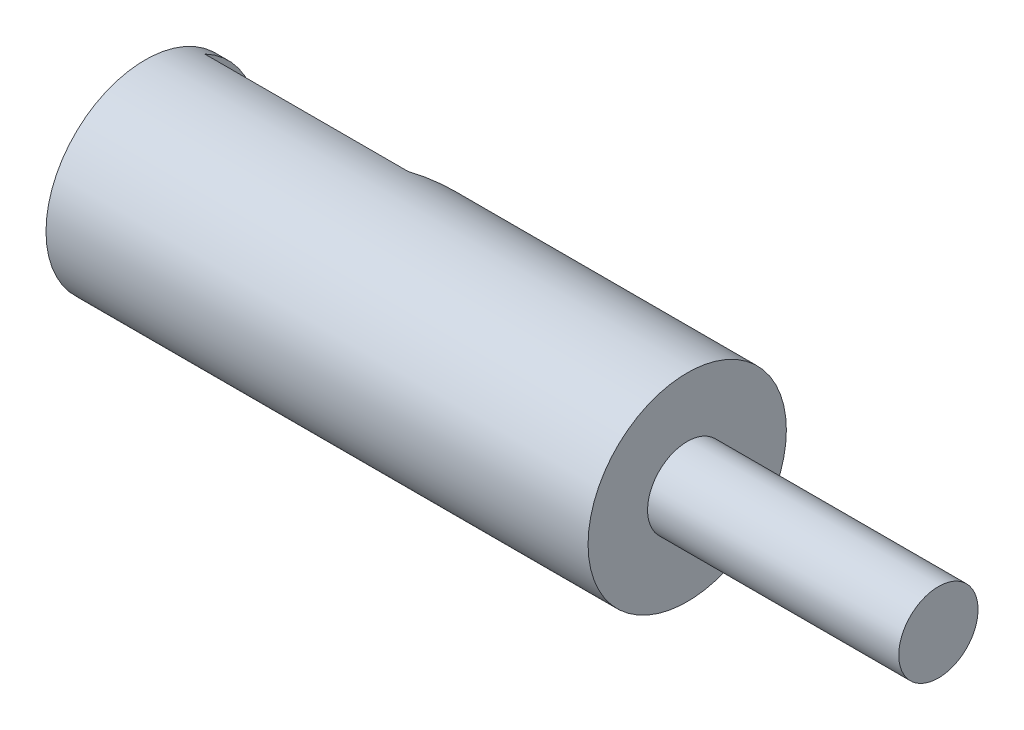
from build123d import *

# Parameters (mm, degrees)
ENL_V_MAT_EXTRU_5_DEPTH = 4


with BuildPart() as part:
    # Esquisse1 → Base-R_volution (revolve)
    with BuildSketch(Plane.XY, mode=Mode.PRIVATE) as base_r_volution_sk:
        Polygon((-80, 7.5), (-39, 7.5), (-39, 3), (-20, 3), (-20, 0), (-41, 0), (-41, 5), (-76, 5), (-76, 6), (-79, 6), (-79, 5), (-80, 5), align=None)
    revolve(base_r_volution_sk.sketch.rotate(Axis((-120, 0, 0), (1, 0, 0)), 90), axis=Axis((-120, 0, 0), (1, 0, 0)))

    # Esquisse2 → Enl_v. mat.-Extru.5 (cut)
    with BuildSketch(Plane.XY.offset(-7.5)):
        with BuildLine():
            Line((-79, 7.5), (-79, -7.5))
            Line((-79, -7.5), (-67, -7.5))
            ThreePointArc((-67, -7.5), (-62.050252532, -5.449747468), (-60, -0.5))
            Line((-60, -0.5), (-60, 0.5))
            ThreePointArc((-60, 0.5), (-62.050252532, 5.449747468), (-67, 7.5))
            Line((-67, 7.5), (-79, 7.5))
        make_face()
    extrude(amount=ENL_V_MAT_EXTRU_5_DEPTH, mode=Mode.SUBTRACT)


solid = part.part
